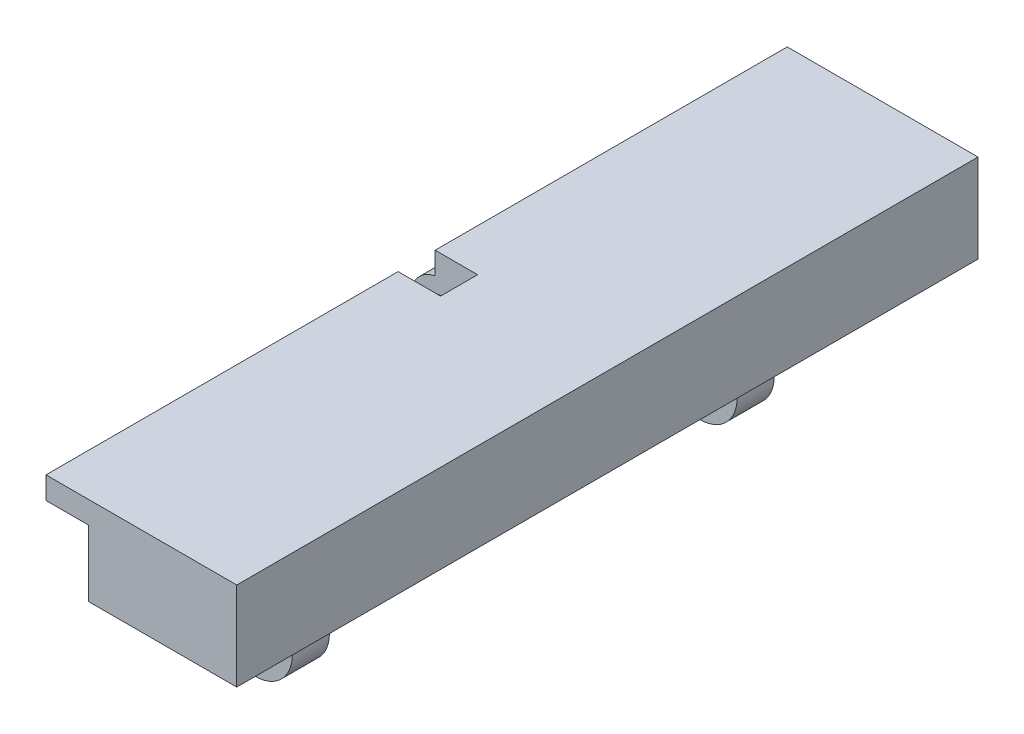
from build123d import *

# Parameters (mm, degrees)
ESQUISSE1_W             = 200
ESQUISSE1_H             = 100
BOSS_EXTRU_1_DEPTH      = 500
BOSS_EXTRU_2_DEPTH      = 25
ESQUISSE3_R             = 30
ENL_V_MAT_EXTRU_1_DEPTH = 845.467287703
CONG_2_R                = 50
BOSS_EXTRU_3_DEPTH      = 25
ESQUISSE5_R             = 20
ENL_V_MAT_EXTRU_2_DEPTH = 624.878994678
ESQUISSE6_W             = 57.323807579
ESQUISSE6_H             = 10.676192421
BOSS_EXTRU_4_DEPTH      = 1000
ESQUISSE7_W             = 257.323807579
ESQUISSE7_H             = 30
BOSS_EXTRU_5_DEPTH      = 1000
ESQUISSE8_W             = 158.091177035
ESQUISSE8_H             = 50
ENL_V_MAT_EXTRU_3_DEPTH = 586.982836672


with BuildPart() as part:
    # Esquisse1 → Boss.-Extru.1 (new, symmetric)
    with BuildSketch(Plane.XY):
        with Locations((0, 50)):
            Rectangle(ESQUISSE1_W, ESQUISSE1_H)
    extrude(amount=BOSS_EXTRU_1_DEPTH, both=True)

    # Esquisse2 → Boss.-Extru.2 (add, symmetric)
    with BuildSketch(Plane.XY.offset(300)):
        with BuildLine():
            Line((0, 0), (0, -100))
            ThreePointArc((0, -100), (-50, -150), (-100, -100))
            Line((-100, -100), (-100, 0))
            Line((-100, 0), (0, 0))
        make_face()
    boss_extru_2 = extrude(amount=BOSS_EXTRU_2_DEPTH, both=True)

    # Sym_trie1: Boss.-Extru.2 across plane
    add(boss_extru_2.mirror(Plane.XY))

    # Esquisse3 → Enl_v. mat.-Extru.1 (cut, through all)
    with BuildSketch(Plane(origin=(0, 0, -325), x_dir=(-1, 0, 0), z_dir=(0, 0, -1))):
        with Locations((50, -100)):
            Circle(ESQUISSE3_R)
    extrude(amount=-ENL_V_MAT_EXTRU_1_DEPTH, mode=Mode.SUBTRACT)

    # Cong_2
    cong_2_edges = [part.edges().sort_by_distance(p)[0] for p in [
        (0, 0, 300),
        (0, 0, -300),
    ]]
    fillet(cong_2_edges, radius=CONG_2_R)

    # Esquisse4 → Boss.-Extru.3 (add, symmetric)
    with BuildSketch(Plane.XY.offset(50)):
        with BuildLine():
            Line((-100, 100), (-157.323807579, 89.323807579))
            ThreePointArc((-157.323807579, 89.323807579), (-190, 50), (-157.323807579, 10.676192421))
            Line((-157.323807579, 10.676192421), (-100, 0))
            Line((-100, 0), (-100, 100))
        make_face()
    boss_extru_3 = extrude(amount=BOSS_EXTRU_3_DEPTH, both=True)

    # Sym_trie2: Boss.-Extru.3 across plane
    add(boss_extru_3.mirror(Plane.XY))

    # Esquisse5 → Enl_v. mat.-Extru.2 (cut, through all)
    with BuildSketch(Plane.XY.offset(75)):
        with Locations(Location((-150, 50, 0), (0, 0, 180))):
            Circle(ESQUISSE5_R)
    extrude(amount=-ENL_V_MAT_EXTRU_2_DEPTH, mode=Mode.SUBTRACT)

    # Esquisse6 → Boss.-Extru.4 (add)
    with BuildSketch(Plane.XY.offset(500)):
        with Locations((-128.66190379, 94.66190379)):
            Rectangle(ESQUISSE6_W, ESQUISSE6_H)
    extrude(amount=-BOSS_EXTRU_4_DEPTH)

    # Esquisse7 → Boss.-Extru.5 (add)
    with BuildSketch(Plane.XY.offset(500)):
        with Locations((-28.66190379, 104.323807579)):
            Rectangle(ESQUISSE7_W, ESQUISSE7_H)
    extrude(amount=-BOSS_EXTRU_5_DEPTH)

    # Esquisse8 → Enl_v. mat.-Extru.3 (cut, through all)
    with BuildSketch(Plane.XZ.offset(-89.323807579)):
        with Locations((-179.045588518, 0)):
            Rectangle(ESQUISSE8_W, ESQUISSE8_H)
    extrude(amount=-ENL_V_MAT_EXTRU_3_DEPTH, mode=Mode.SUBTRACT)


solid = part.part
